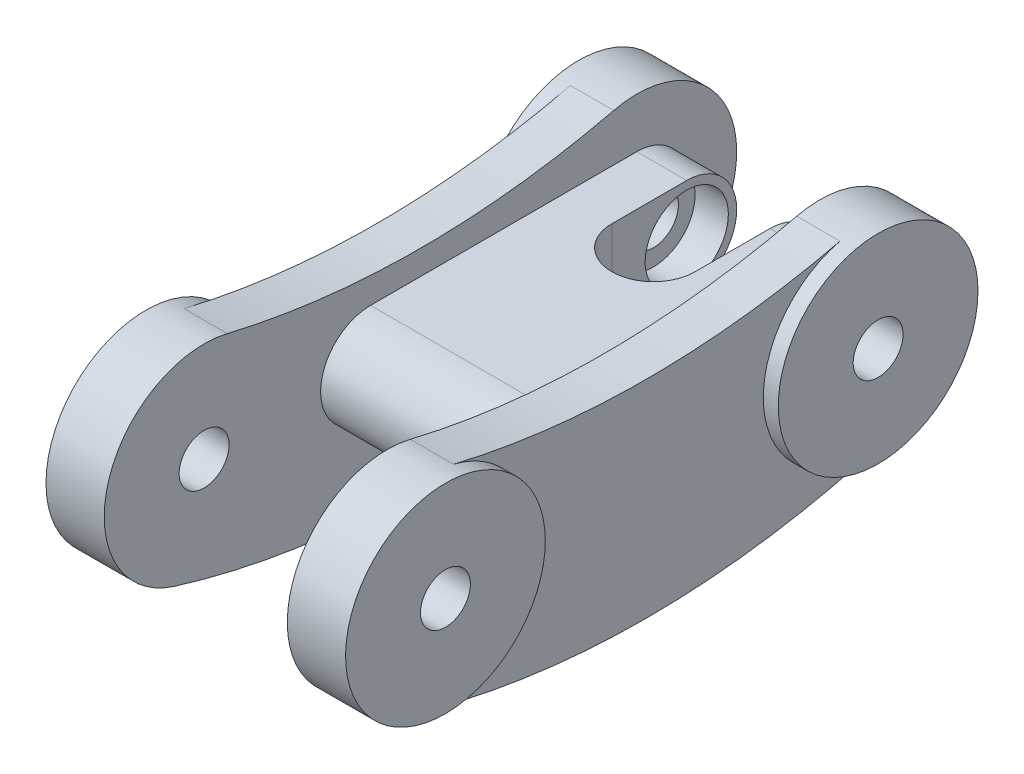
from build123d import *

# Parameters (mm, degrees)
BOSS_EXTRUDE1_DEPTH = 3.302
SKETCH2_R           = 1.905
CUT_EXTRUDE1_DEPTH  = 3.302
BOSS_EXTRUDE2_START = 13.97
BOSS_EXTRUDE2_DEPTH = 13.97
SKETCH6_R           = 1.905
BOSS_EXTRUDE3_DEPTH = 3.302
SKETCH7_W           = 6.35
SKETCH7_H           = 3.81
CUT_EXTRUDE2_DEPTH  = 12.7
SKETCH8_R           = 0.9525
CUT_EXTRUDE3_DEPTH  = 7.62
SKETCH9_R           = 3.175
CUT_EXTRUDE4_DEPTH  = 2.54
CUT_EXTRUDE5_START  = -2.54
SKETCH10_R          = 3.175
CUT_EXTRUDE5_DEPTH  = 2.54
SKETCH12_R          = 7.62
SKETCH12_R_2        = 1.905
BOSS_EXTRUDE4_DEPTH = 1.143
BOSS_EXTRUDE5_START = 1.143
SKETCH13_R          = 7.62
SKETCH13_R_2        = 1.905
BOSS_EXTRUDE5_DEPTH = 1.143
SKETCH14_R          = 7.62
SKETCH14_R_2        = 1.905
BOSS_EXTRUDE6_DEPTH = 1.143
BOSS_EXTRUDE7_START = 1.143
SKETCH15_R          = 7.62
SKETCH15_R_2        = 1.905
BOSS_EXTRUDE7_DEPTH = 1.143


with BuildPart() as part:
    # Sketch1 → Boss-Extrude1 (new body)
    with BuildSketch(Plane(origin=(0, 0, 0), x_dir=(0, 0, -1), z_dir=(1, 0, 0))):
        with BuildLine():
            ThreePointArc((-14.741071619, 7.411834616), (-15.619432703, 7.56777972), (-16.51, 7.62))
            Line((-16.51, 7.62), (-16.51, -7.62))
            ThreePointArc((-16.51, -7.62), (-11.121846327, -5.388153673), (-8.89, 0))
            ThreePointArc((-8.89, 0), (-10.529045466, 4.721502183), (-14.741071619, 7.411834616))
        make_face()
        with BuildLine():
            Line((-16.51, -7.62), (-16.51, 7.62))
            ThreePointArc((-16.51, 7.62), (-24.044474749, 1.138459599), (-18.761363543, -7.27981883))
            ThreePointArc((-18.761363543, -7.27981883), (-17.648459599, -7.534474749), (-16.51, -7.62))
        make_face()
        with BuildLine():
            ThreePointArc((-14.741071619, 7.411834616), (-15.619432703, 7.56777972), (-16.51, 7.62))
            Line((-16.51, 7.62), (-16.51, -7.62))
            ThreePointArc((-16.51, -7.62), (-11.121846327, -5.388153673), (-8.89, 0))
            ThreePointArc((-8.89, 0), (-10.529045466, 4.721502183), (-14.741071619, 7.411834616))
        make_face()
        with BuildLine():
            Line((-16.51, -7.62), (-16.51, 7.62))
            ThreePointArc((-16.51, 7.62), (-24.044474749, 1.138459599), (-18.761363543, -7.27981883))
            ThreePointArc((-18.761363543, -7.27981883), (-17.648459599, -7.534474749), (-16.51, -7.62))
        make_face()
        with BuildLine():
            ThreePointArc((-8.89, 0), (-11.121846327, -5.388153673), (-16.51, -7.62))
            Line((-16.51, -7.62), (16.51, -7.62))
            ThreePointArc((16.51, -7.62), (8.94222028, -0.890567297), (14.741071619, 7.411834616))
            ThreePointArc((14.741071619, 7.411834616), (0, 5.677122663), (-14.741071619, 7.411834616))
            ThreePointArc((-14.741071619, 7.411834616), (-10.529045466, 4.721502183), (-8.89, 0))
        make_face()
        with BuildLine():
            ThreePointArc((14.741071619, 7.411834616), (8.94222028, -0.890567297), (16.51, -7.62))
            Line((16.51, -7.62), (16.51, 7.62))
            ThreePointArc((16.51, 7.62), (15.619432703, 7.56777972), (14.741071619, 7.411834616))
        make_face()
        with BuildLine():
            Line((16.51, 7.62), (16.51, -7.62))
            ThreePointArc((16.51, -7.62), (17.648459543, -7.534474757), (18.761363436, -7.279818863))
            ThreePointArc((18.761363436, -7.279818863), (22.642690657, -4.52266573), (24.13, 0))
            ThreePointArc((24.13, 0), (21.898153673, 5.388153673), (16.51, 7.62))
        make_face()
        with BuildLine():
            ThreePointArc((14.741071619, 7.411834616), (8.94222028, -0.890567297), (16.51, -7.62))
            Line((16.51, -7.62), (16.51, 7.62))
            ThreePointArc((16.51, 7.62), (15.619432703, 7.56777972), (14.741071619, 7.411834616))
        make_face()
        with BuildLine():
            Line((16.51, 7.62), (16.51, -7.62))
            ThreePointArc((16.51, -7.62), (17.648459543, -7.534474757), (18.761363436, -7.279818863))
            ThreePointArc((18.761363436, -7.279818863), (22.642690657, -4.52266573), (24.13, 0))
            ThreePointArc((24.13, 0), (21.898153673, 5.388153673), (16.51, 7.62))
        make_face()
        with BuildLine():
            Line((16.51, -7.62), (-16.51, -7.62))
            ThreePointArc((-16.51, -7.62), (-17.648459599, -7.534474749), (-18.761363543, -7.27981883))
            ThreePointArc((-18.761363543, -7.27981883), (-5.6e-08, -10.114662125), (18.761363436, -7.279818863))
            ThreePointArc((18.761363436, -7.279818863), (17.648459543, -7.534474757), (16.51, -7.62))
        make_face()
    extrude(amount=BOSS_EXTRUDE1_DEPTH)

    # Sketch2 → Cut-Extrude1 (cut)
    with BuildSketch(Plane(origin=(3.302, 0, 0), x_dir=(0, 0, -1), z_dir=(1, 0, 0))):
        with Locations((16.51, 0)):
            Circle(SKETCH2_R)
        with Locations((-16.51, 0)):
            Circle(SKETCH2_R)
    extrude(amount=-CUT_EXTRUDE1_DEPTH, mode=Mode.SUBTRACT)

    # Sketch3 → Boss-Extrude2 (add)
    with BuildSketch(Plane(origin=(3.302, 0, 0), x_dir=(0, 0, -1), z_dir=(1, 0, 0)).offset(BOSS_EXTRUDE2_START)):
        with BuildLine():
            ThreePointArc((16.51, -3.81), (12.7, 0), (16.51, 3.81))
            Line((16.51, 3.81), (-3.81, 3.81))
            ThreePointArc((-3.81, 3.81), (-1.115923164, 2.694076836), (0, 0))
            ThreePointArc((0, 0), (-1.115923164, -2.694076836), (-3.81, -3.81))
            Line((-3.81, -3.81), (16.51, -3.81))
        make_face()
        with BuildLine():
            ThreePointArc((0, 0), (-1.115923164, 2.694076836), (-3.81, 3.81))
            Line((-3.81, 3.81), (-3.81, -3.81))
            ThreePointArc((-3.81, -3.81), (-1.115923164, -2.694076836), (0, 0))
        make_face()
        with BuildLine():
            Line((-3.81, -3.81), (-3.81, 3.81))
            ThreePointArc((-3.81, 3.81), (-7.62, 0), (-3.81, -3.81))
        make_face()
        with BuildLine():
            ThreePointArc((0, 0), (-1.115923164, 2.694076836), (-3.81, 3.81))
            Line((-3.81, 3.81), (-3.81, -3.81))
            ThreePointArc((-3.81, -3.81), (-1.115923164, -2.694076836), (0, 0))
        make_face()
        with BuildLine():
            Line((-3.81, -3.81), (-3.81, 3.81))
            ThreePointArc((-3.81, 3.81), (-7.62, 0), (-3.81, -3.81))
        make_face()
        with BuildLine():
            ThreePointArc((20.32, 0), (19.204076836, 2.694076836), (16.51, 3.81))
            Line((16.51, 3.81), (16.51, 1.905))
            ThreePointArc((16.51, 1.905), (17.857038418, 1.347038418), (18.415, 0))
            ThreePointArc((18.415, 0), (17.857038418, -1.347038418), (16.51, -1.905))
            Line((16.51, -1.905), (16.51, -3.81))
            ThreePointArc((16.51, -3.81), (19.204076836, -2.694076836), (20.32, 0))
        make_face()
        with BuildLine():
            Line((16.51, 1.905), (16.51, 3.81))
            ThreePointArc((16.51, 3.81), (12.7, 0), (16.51, -3.81))
            Line((16.51, -3.81), (16.51, -1.905))
            ThreePointArc((16.51, -1.905), (14.605, 0), (16.51, 1.905))
        make_face()
        with BuildLine():
            ThreePointArc((20.32, 0), (19.204076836, 2.694076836), (16.51, 3.81))
            Line((16.51, 3.81), (16.51, 1.905))
            ThreePointArc((16.51, 1.905), (17.857038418, 1.347038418), (18.415, 0))
            ThreePointArc((18.415, 0), (17.857038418, -1.347038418), (16.51, -1.905))
            Line((16.51, -1.905), (16.51, -3.81))
            ThreePointArc((16.51, -3.81), (19.204076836, -2.694076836), (20.32, 0))
        make_face()
        with BuildLine():
            Line((16.51, 1.905), (16.51, 3.81))
            ThreePointArc((16.51, 3.81), (12.7, 0), (16.51, -3.81))
            Line((16.51, -3.81), (16.51, -1.905))
            ThreePointArc((16.51, -1.905), (14.605, 0), (16.51, 1.905))
        make_face()
    extrude(amount=-BOSS_EXTRUDE2_DEPTH)

    # Sketch6 → Boss-Extrude3 (add)
    with BuildSketch(Plane(origin=(17.272, 0, 0), x_dir=(0, 0, -1), z_dir=(1, 0, 0))):
        with BuildLine():
            ThreePointArc((-14.741071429, 7.411834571), (0, 5.677122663), (14.741071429, 7.411834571))
            ThreePointArc((14.741071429, 7.411834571), (23.859786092, 2.011229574), (18.761363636, -7.279818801))
            ThreePointArc((18.761363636, -7.279818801), (0, -10.114662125), (-18.761363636, -7.279818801))
            ThreePointArc((-18.761363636, -7.279818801), (-23.859786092, 2.011229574), (-14.741071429, 7.411834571))
        make_face()
        with Locations((16.51, 0)):
            Circle(SKETCH6_R, mode=Mode.SUBTRACT)
        with Locations((-16.51, 0)):
            Circle(SKETCH6_R, mode=Mode.SUBTRACT)
    extrude(amount=BOSS_EXTRUDE3_DEPTH)

    # Sketch7 → Cut-Extrude2 (cut)
    with BuildSketch(Plane(origin=(0, 3.81, 0), x_dir=(1, 0, 0), z_dir=(0, 1, 0))):
        with BuildLine():
            Line((13.462, 16.51), (7.112, 16.51))
            Line((7.112, 16.51), (7.112, 10.795))
            ThreePointArc((7.112, 10.795), (10.287, 13.97), (13.462, 10.795))
            Line((13.462, 10.795), (13.462, 16.51))
        make_face()
        with Locations((10.287, 18.415)):
            Rectangle(SKETCH7_W, SKETCH7_H)
        with BuildLine():
            ThreePointArc((13.462, 10.795), (10.287, 13.97), (7.112, 10.795))
            Line((7.112, 10.795), (13.462, 10.795))
        make_face()
        with BuildLine():
            Line((13.462, 10.795), (7.112, 10.795))
            ThreePointArc((7.112, 10.795), (10.287, 7.62), (13.462, 10.795))
        make_face()
        with BuildLine():
            ThreePointArc((13.462, 10.795), (10.287, 13.97), (7.112, 10.795))
            Line((7.112, 10.795), (13.462, 10.795))
        make_face()
        with BuildLine():
            Line((13.462, 10.795), (7.112, 10.795))
            ThreePointArc((7.112, 10.795), (10.287, 7.62), (13.462, 10.795))
        make_face()
    extrude(amount=-CUT_EXTRUDE2_DEPTH, mode=Mode.SUBTRACT)

    # Sketch8 → Cut-Extrude3 (cut)
    with BuildSketch(Plane.XY.offset(-10.16)):
        with Locations(Location((10.16, 0, 0), (0, 0, 180))):
            Circle(SKETCH8_R)
    extrude(amount=CUT_EXTRUDE3_DEPTH, mode=Mode.SUBTRACT)

    # Sketch9 → Cut-Extrude4 (cut)
    with BuildSketch(Plane(origin=(7.112, 0, 0), x_dir=(0, 0, -1), z_dir=(1, 0, 0))):
        with Locations((16.51, 0)):
            Circle(SKETCH9_R)
    extrude(amount=-CUT_EXTRUDE4_DEPTH, mode=Mode.SUBTRACT)

    # Sketch10 → Cut-Extrude5 (cut)
    with BuildSketch(Plane.ZY.offset(-13.462).offset(CUT_EXTRUDE5_START)):
        with Locations(Location((-16.51, 0, 0), (0, 0, 180))):
            Circle(SKETCH10_R)
    extrude(amount=CUT_EXTRUDE5_DEPTH, mode=Mode.SUBTRACT)

    # Sketch12 → Boss-Extrude4 (add)
    with BuildSketch(Plane.ZY):
        with Locations((-16.51, 0)):
            Circle(SKETCH12_R)
        with Locations(Location((-16.51, 0, 0), (0, 0, 180))):
            Circle(SKETCH12_R_2, mode=Mode.SUBTRACT)
    extrude(amount=BOSS_EXTRUDE4_DEPTH)

    # Sketch13 → Boss-Extrude5 (add)
    with BuildSketch(Plane(origin=(20.574, 0, 0), x_dir=(0, 0, -1), z_dir=(1, 0, 0)).offset(BOSS_EXTRUDE5_START)):
        with Locations(Location((16.51, 0, 0), (0, 0, 180))):
            Circle(SKETCH13_R)
        with Locations((16.51, 0)):
            Circle(SKETCH13_R_2, mode=Mode.SUBTRACT)
    extrude(amount=-BOSS_EXTRUDE5_DEPTH)

    # Sketch14 → Boss-Extrude6 (add)
    with BuildSketch(Plane(origin=(20.574, 0, 0), x_dir=(0, 0, -1), z_dir=(1, 0, 0))):
        with Locations(Location((-16.51, 0, 0), (0, 0, 252.815204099))):
            Circle(SKETCH14_R)
        with Locations((-16.51, 0)):
            Circle(SKETCH14_R_2, mode=Mode.SUBTRACT)
    extrude(amount=BOSS_EXTRUDE6_DEPTH)

    # Sketch15 → Boss-Extrude7 (add)
    with BuildSketch(Plane.ZY.offset(BOSS_EXTRUDE7_START)):
        with Locations((16.51, 0)):
            Circle(SKETCH15_R)
        with Locations(Location((16.51, 0, 0), (0, 0, 180))):
            Circle(SKETCH15_R_2, mode=Mode.SUBTRACT)
    extrude(amount=-BOSS_EXTRUDE7_DEPTH)


solid = part.part
